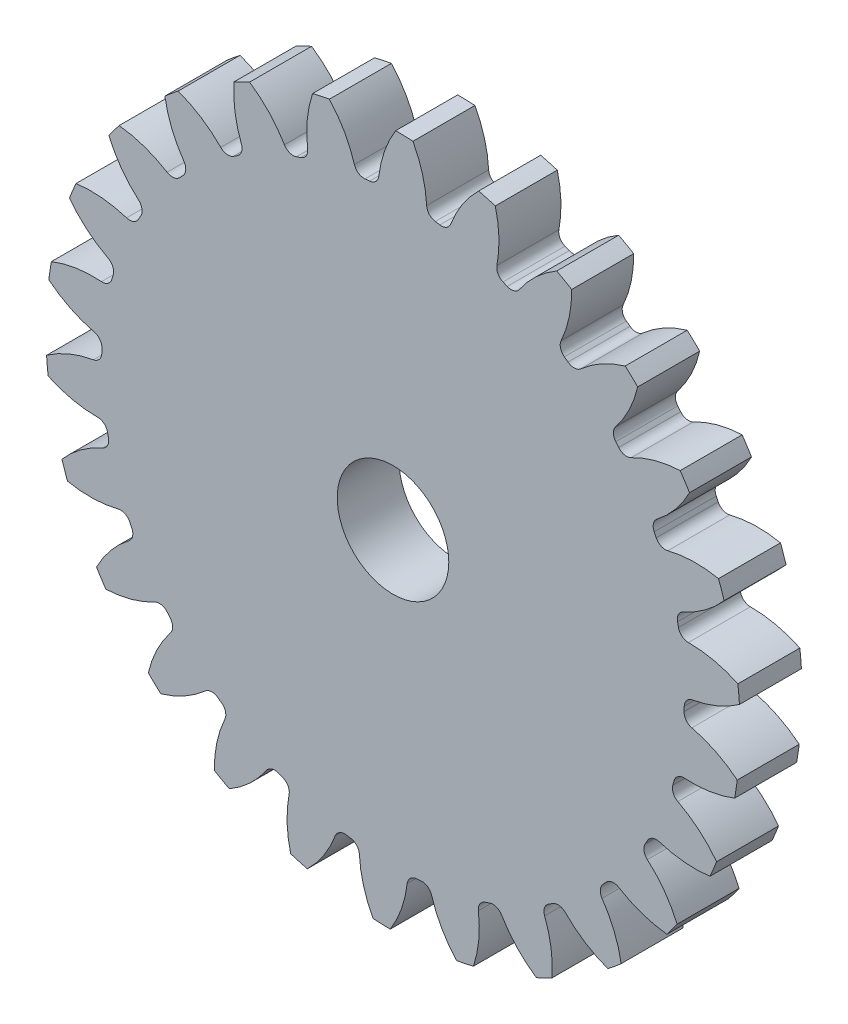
from build123d import *

# Parameters (mm, degrees)
SKETCH3_R         = 711.2
GEARBODY_DEPTH    = 127
TOOTHCUT_DEPTH    = 1014.775063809
CIRPATTERN1_COUNT = 26
BOREDIA_R         = 114.3
BORE_DEPTH        = 12700


with BuildPart() as part:
    # Sketch3 → gearBody (new body)
    with BuildSketch(Plane.XY):
        Circle(SKETCH3_R)
    extrude(amount=GEARBODY_DEPTH)

    # Sketch2 → toothCut (cut, through all)
    with BuildSketch(Plane.XY):
        with BuildLine():
            ThreePointArc((596.411068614, -24.154652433), (596.582840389, -19.455707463), (596.717591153, -14.755555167))
            ThreePointArc((596.717591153, -14.755555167), (601.727254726, -1.766410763), (613.836804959, 5.101878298))
            ThreePointArc((613.836804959, 5.101878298), (664.841877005, 20.071309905), (711.2, 46.081417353))
            ThreePointArc((711.2, 46.081417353), (712.312648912, -23.229877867), (706.686419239, -92.321405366))
            ThreePointArc((706.686419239, -92.321405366), (662.121474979, -63.346122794), (612.200105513, -45.085286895))
            ThreePointArc((612.200105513, -45.085286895), (600.563785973, -37.442599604), (596.411068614, -24.154652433))
        make_face()
    toothcut = extrude(amount=TOOTHCUT_DEPTH, mode=Mode.SUBTRACT)

    # CirPattern1: toothCut ×26 about axis
    cirpattern1_axis = Axis((0, 0, 0), (0, 0, 1))
    for i in range(1, CIRPATTERN1_COUNT):
        add(toothcut.rotate(cirpattern1_axis, i * 360 / CIRPATTERN1_COUNT), mode=Mode.SUBTRACT)

    # boreDia → bore (cut, symmetric)
    with BuildSketch(Plane.XY):
        Circle(BOREDIA_R)
    extrude(amount=BORE_DEPTH, both=True, mode=Mode.SUBTRACT)


solid = part.part
